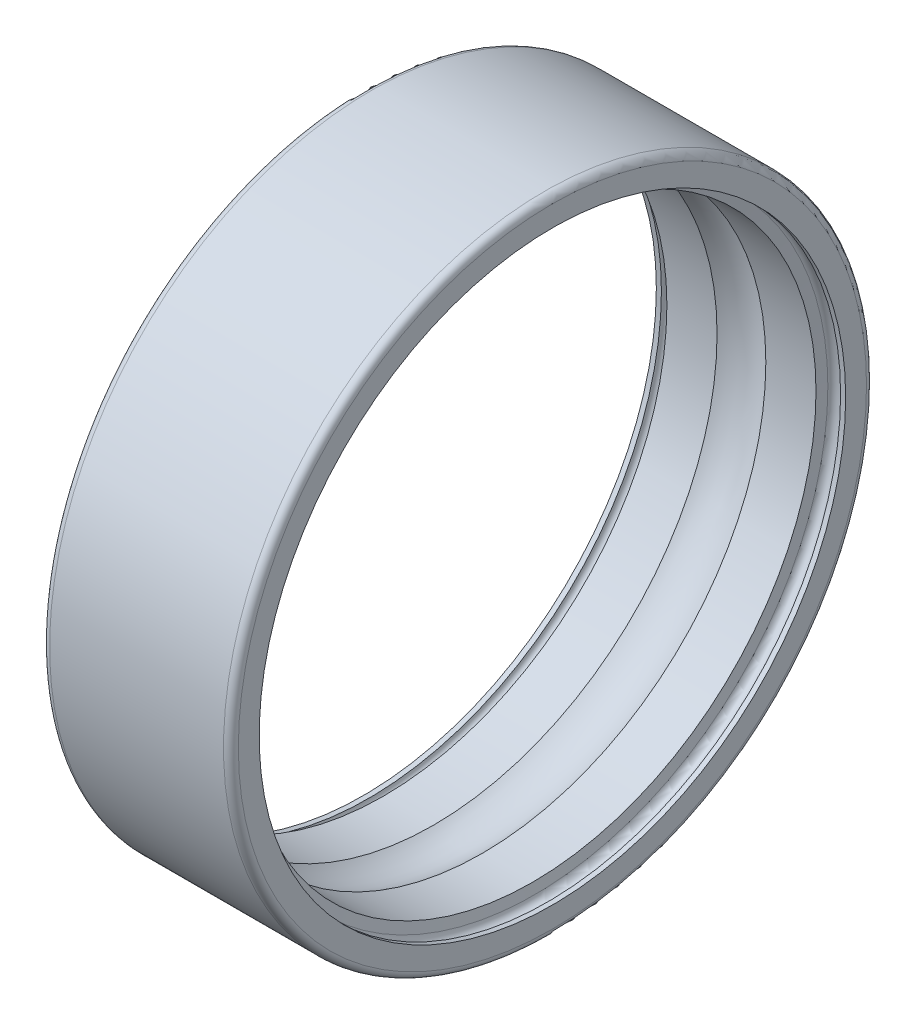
from build123d import *


with BuildPart() as part:
    # Sketch1 → Revolve1 (revolve)
    with BuildSketch(Plane.XY, mode=Mode.PRIVATE) as revolve1_sk:
        with BuildLine():
            Line((0, 8.3), (0, 7.748743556))
            Line((0, 7.748743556), (0.133966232, 7.748959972))
            ThreePointArc((0.133966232, 7.748959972), (0.299944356, 7.913392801), (0.482429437, 7.767495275))
            Line((0.482429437, 7.767495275), (0.528010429, 7.5))
            Line((0.528010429, 7.5), (1.854941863, 7.5))
            ThreePointArc((1.854941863, 7.5), (2.163770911, 7.641512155), (2.5, 7.69))
            ThreePointArc((2.5, 7.69), (2.836229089, 7.641512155), (3.145058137, 7.5))
            Line((3.145058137, 7.5), (4.471989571, 7.5))
            Line((4.471989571, 7.5), (4.51837854, 7.76735634))
            ThreePointArc((4.51837854, 7.76735634), (4.696873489, 7.912894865), (4.866033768, 7.756604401))
            Line((4.866033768, 7.756604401), (5, 7.756820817))
            Line((5, 7.756820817), (5, 8.308077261))
            ThreePointArc((5, 8.308077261), (4.940911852, 8.446672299), (4.8, 8.5))
            Line((4.8, 8.5), (0.2, 8.5))
            ThreePointArc((0.2, 8.5), (0.058578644, 8.441421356), (0, 8.3))
        make_face()
    revolve(revolve1_sk.sketch.rotate(Axis((50, 0, 0), (-1, 0, 0)), 90), axis=Axis((50, 0, 0), (-1, 0, 0)))


solid = part.part
